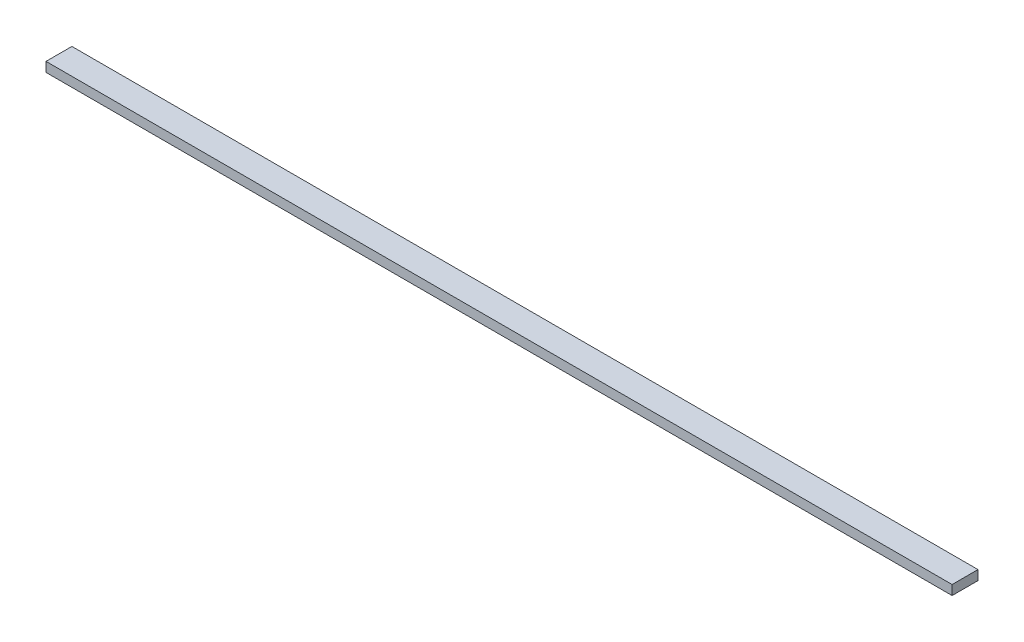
ISO-10303-21;
HEADER;
FILE_DESCRIPTION(('STEP AP214'),'2;1');
FILE_NAME('part.step','',(''),(''),'','','');
FILE_SCHEMA(('AUTOMOTIVE_DESIGN { 1 0 10303 214 1 1 1 1 }'));
ENDSEC;
DATA;
#1=APPLICATION_CONTEXT('core data for automotive mechanical design processes');
#2=APPLICATION_PROTOCOL_DEFINITION('international standard','automotive_design',2000,#1);
#3=PRODUCT_CONTEXT('',#1,'mechanical');
#4=PRODUCT('Part','Part','',(#3));
#5=PRODUCT_RELATED_PRODUCT_CATEGORY('part','',(#4));
#6=PRODUCT_DEFINITION_FORMATION('','',#4);
#7=PRODUCT_DEFINITION_CONTEXT('part definition',#1,'design');
#8=PRODUCT_DEFINITION('design','',#6,#7);
#9=PRODUCT_DEFINITION_SHAPE('','',#8);
#10=(LENGTH_UNIT() NAMED_UNIT(*) SI_UNIT(.MILLI.,.METRE.));
#11=(NAMED_UNIT(*) PLANE_ANGLE_UNIT() SI_UNIT($,.RADIAN.));
#12=(NAMED_UNIT(*) SI_UNIT($,.STERADIAN.) SOLID_ANGLE_UNIT());
#13=UNCERTAINTY_MEASURE_WITH_UNIT(LENGTH_MEASURE(1.E-05),#10,'distance_accuracy_value','');
#14=(GEOMETRIC_REPRESENTATION_CONTEXT(3) GLOBAL_UNCERTAINTY_ASSIGNED_CONTEXT((#13)) GLOBAL_UNIT_ASSIGNED_CONTEXT((#10,
#11,#12)) REPRESENTATION_CONTEXT('',''));
#15=CARTESIAN_POINT('',(0.,0.,0.));
#16=DIRECTION('',(0.,0.,1.));
#17=DIRECTION('',(1.,0.,0.));
#18=AXIS2_PLACEMENT_3D('',#15,#16,#17);
#19=CARTESIAN_POINT('',(300.0375,6.35,8.5725));
#20=DIRECTION('',(-1.,0.,0.));
#21=DIRECTION('',(0.,0.,1.));
#22=AXIS2_PLACEMENT_3D('',#19,#20,#21);
#23=PLANE('',#22);
#24=DIRECTION('',(0.,0.,-1.));
#25=VECTOR('',#24,1.);
#26=CARTESIAN_POINT('',(300.0375,0.,8.5725));
#27=LINE('',#26,#25);
#28=CARTESIAN_POINT('',(300.0375,0.,8.5725));
#29=VERTEX_POINT('',#28);
#30=CARTESIAN_POINT('',(300.0375,0.,-8.5725));
#31=VERTEX_POINT('',#30);
#32=EDGE_CURVE('E96',#29,#31,#27,.T.);
#33=ORIENTED_EDGE('',*,*,#32,.T.);
#34=DIRECTION('',(0.,-1.,0.));
#35=VECTOR('',#34,1.);
#36=CARTESIAN_POINT('',(300.0375,6.35,-8.5725));
#37=LINE('',#36,#35);
#38=CARTESIAN_POINT('',(300.0375,6.35,-8.5725));
#39=VERTEX_POINT('',#38);
#40=EDGE_CURVE('E11',#39,#31,#37,.T.);
#41=ORIENTED_EDGE('',*,*,#40,.F.);
#42=DIRECTION('',(0.,0.,-1.));
#43=VECTOR('',#42,1.);
#44=CARTESIAN_POINT('',(300.0375,6.35,8.5725));
#45=LINE('',#44,#43);
#46=CARTESIAN_POINT('',(300.0375,6.35,8.5725));
#47=VERTEX_POINT('',#46);
#48=EDGE_CURVE('E84',#47,#39,#45,.T.);
#49=ORIENTED_EDGE('',*,*,#48,.F.);
#50=DIRECTION('',(0.,-1.,0.));
#51=VECTOR('',#50,1.);
#52=CARTESIAN_POINT('',(300.0375,6.35,8.5725));
#53=LINE('',#52,#51);
#54=EDGE_CURVE('E92',#47,#29,#53,.T.);
#55=ORIENTED_EDGE('',*,*,#54,.T.);
#56=EDGE_LOOP('',(#33,#41,#49,#55));
#57=FACE_BOUND('',#56,.T.);
#58=ADVANCED_FACE('F33',(#57),#23,.F.);
#59=CARTESIAN_POINT('',(-300.0375,6.35,-8.5725));
#60=DIRECTION('',(0.,0.,1.));
#61=DIRECTION('',(1.,0.,0.));
#62=AXIS2_PLACEMENT_3D('',#59,#60,#61);
#63=PLANE('',#62);
#64=DIRECTION('',(-1.,0.,0.));
#65=VECTOR('',#64,1.);
#66=CARTESIAN_POINT('',(-300.0375,0.,-8.5725));
#67=LINE('',#66,#65);
#68=CARTESIAN_POINT('',(-300.0375,0.,-8.5725));
#69=VERTEX_POINT('',#68);
#70=EDGE_CURVE('E88',#31,#69,#67,.T.);
#71=ORIENTED_EDGE('',*,*,#70,.T.);
#72=DIRECTION('',(0.,-1.,0.));
#73=VECTOR('',#72,1.);
#74=CARTESIAN_POINT('',(-300.0375,6.35,-8.5725));
#75=LINE('',#74,#73);
#76=CARTESIAN_POINT('',(-300.0375,6.35,-8.5725));
#77=VERTEX_POINT('',#76);
#78=EDGE_CURVE('E41',#77,#69,#75,.T.);
#79=ORIENTED_EDGE('',*,*,#78,.F.);
#80=DIRECTION('',(-1.,0.,0.));
#81=VECTOR('',#80,1.);
#82=CARTESIAN_POINT('',(-300.0375,6.35,-8.5725));
#83=LINE('',#82,#81);
#84=EDGE_CURVE('E79',#39,#77,#83,.T.);
#85=ORIENTED_EDGE('',*,*,#84,.F.);
#86=ORIENTED_EDGE('',*,*,#40,.T.);
#87=EDGE_LOOP('',(#71,#79,#85,#86));
#88=FACE_BOUND('',#87,.T.);
#89=ADVANCED_FACE('F87',(#88),#63,.F.);
#90=CARTESIAN_POINT('',(-300.0375,6.35,8.5725));
#91=DIRECTION('',(1.,0.,0.));
#92=DIRECTION('',(0.,0.,-1.));
#93=AXIS2_PLACEMENT_3D('',#90,#91,#92);
#94=PLANE('',#93);
#95=DIRECTION('',(0.,0.,1.));
#96=VECTOR('',#95,1.);
#97=CARTESIAN_POINT('',(-300.0375,0.,8.5725));
#98=LINE('',#97,#96);
#99=CARTESIAN_POINT('',(-300.0375,0.,8.5725));
#100=VERTEX_POINT('',#99);
#101=EDGE_CURVE('E66',#69,#100,#98,.T.);
#102=ORIENTED_EDGE('',*,*,#101,.T.);
#103=DIRECTION('',(0.,-1.,0.));
#104=VECTOR('',#103,1.);
#105=CARTESIAN_POINT('',(-300.0375,6.35,8.5725));
#106=LINE('',#105,#104);
#107=CARTESIAN_POINT('',(-300.0375,6.35,8.5725));
#108=VERTEX_POINT('',#107);
#109=EDGE_CURVE('E89',#108,#100,#106,.T.);
#110=ORIENTED_EDGE('',*,*,#109,.F.);
#111=DIRECTION('',(0.,0.,1.));
#112=VECTOR('',#111,1.);
#113=CARTESIAN_POINT('',(-300.0375,6.35,8.5725));
#114=LINE('',#113,#112);
#115=EDGE_CURVE('E82',#77,#108,#114,.T.);
#116=ORIENTED_EDGE('',*,*,#115,.F.);
#117=ORIENTED_EDGE('',*,*,#78,.T.);
#118=EDGE_LOOP('',(#102,#110,#116,#117));
#119=FACE_BOUND('',#118,.T.);
#120=ADVANCED_FACE('F90',(#119),#94,.F.);
#121=CARTESIAN_POINT('',(-300.0375,6.35,8.5725));
#122=DIRECTION('',(0.,0.,-1.));
#123=DIRECTION('',(-1.,0.,0.));
#124=AXIS2_PLACEMENT_3D('',#121,#122,#123);
#125=PLANE('',#124);
#126=DIRECTION('',(1.,0.,0.));
#127=VECTOR('',#126,1.);
#128=CARTESIAN_POINT('',(-300.0375,0.,8.5725));
#129=LINE('',#128,#127);
#130=EDGE_CURVE('E72',#100,#29,#129,.T.);
#131=ORIENTED_EDGE('',*,*,#130,.T.);
#132=ORIENTED_EDGE('',*,*,#54,.F.);
#133=DIRECTION('',(1.,0.,0.));
#134=VECTOR('',#133,1.);
#135=CARTESIAN_POINT('',(-300.0375,6.35,8.5725));
#136=LINE('',#135,#134);
#137=EDGE_CURVE('E49',#108,#47,#136,.T.);
#138=ORIENTED_EDGE('',*,*,#137,.F.);
#139=ORIENTED_EDGE('',*,*,#109,.T.);
#140=EDGE_LOOP('',(#131,#132,#138,#139));
#141=FACE_BOUND('',#140,.T.);
#142=ADVANCED_FACE('F103',(#141),#125,.F.);
#143=CARTESIAN_POINT('',(0.,6.35,0.));
#144=DIRECTION('',(0.,-1.,0.));
#145=DIRECTION('',(0.,0.,-1.));
#146=AXIS2_PLACEMENT_3D('',#143,#144,#145);
#147=PLANE('',#146);
#148=ORIENTED_EDGE('',*,*,#48,.T.);
#149=ORIENTED_EDGE('',*,*,#84,.T.);
#150=ORIENTED_EDGE('',*,*,#115,.T.);
#151=ORIENTED_EDGE('',*,*,#137,.T.);
#152=EDGE_LOOP('',(#148,#149,#150,#151));
#153=FACE_BOUND('',#152,.T.);
#154=ADVANCED_FACE('F80',(#153),#147,.F.);
#155=CARTESIAN_POINT('',(0.,0.,0.));
#156=DIRECTION('',(0.,-1.,0.));
#157=DIRECTION('',(0.,0.,-1.));
#158=AXIS2_PLACEMENT_3D('',#155,#156,#157);
#159=PLANE('',#158);
#160=ORIENTED_EDGE('',*,*,#32,.F.);
#161=ORIENTED_EDGE('',*,*,#130,.F.);
#162=ORIENTED_EDGE('',*,*,#101,.F.);
#163=ORIENTED_EDGE('',*,*,#70,.F.);
#164=EDGE_LOOP('',(#160,#161,#162,#163));
#165=FACE_BOUND('',#164,.T.);
#166=ADVANCED_FACE('F106',(#165),#159,.T.);
#167=CLOSED_SHELL('',(#58,#89,#120,#142,#154,#166));
#168=MANIFOLD_SOLID_BREP('B2',#167);
#169=ADVANCED_BREP_SHAPE_REPRESENTATION('',(#18,#168),#14);
#170=SHAPE_DEFINITION_REPRESENTATION(#9,#169);
ENDSEC;
END-ISO-10303-21;
